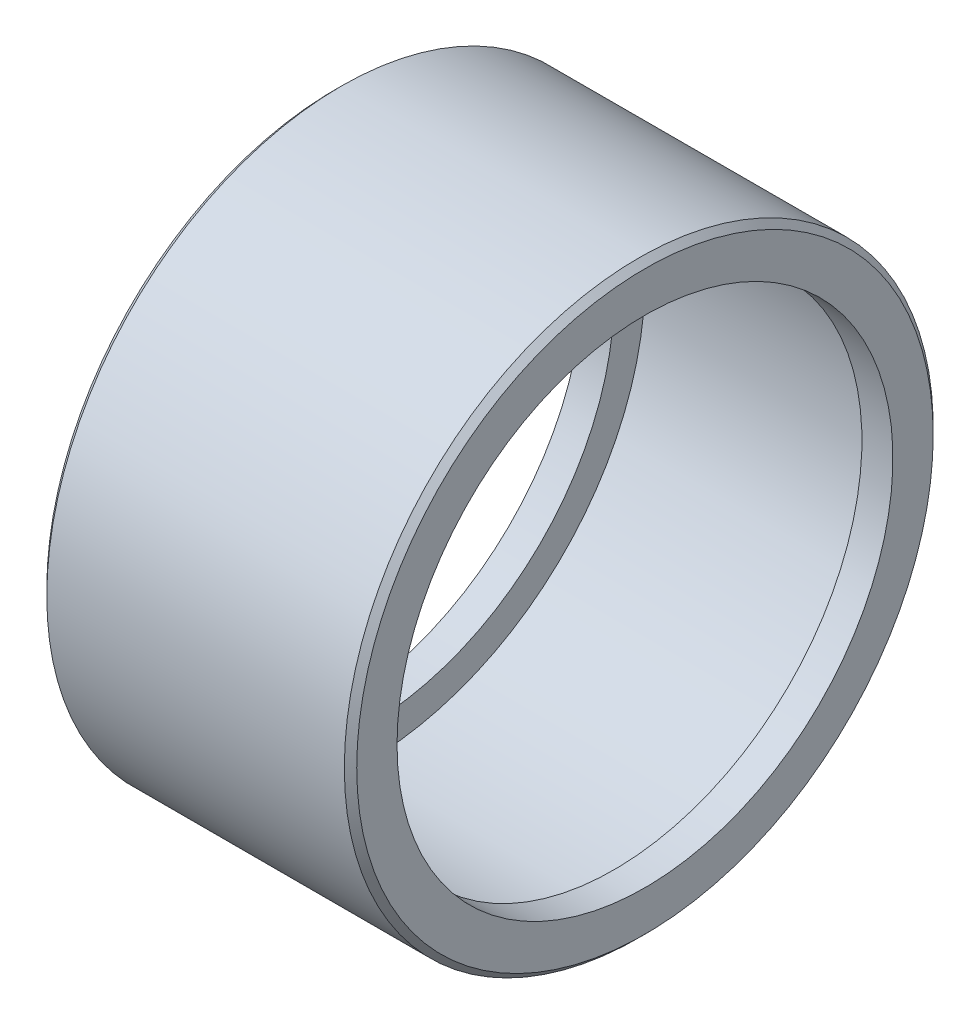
ISO-10303-21;
HEADER;
FILE_DESCRIPTION(('STEP AP214'),'2;1');
FILE_NAME('part.step','',(''),(''),'','','');
FILE_SCHEMA(('AUTOMOTIVE_DESIGN { 1 0 10303 214 1 1 1 1 }'));
ENDSEC;
DATA;
#1=APPLICATION_CONTEXT('core data for automotive mechanical design processes');
#2=APPLICATION_PROTOCOL_DEFINITION('international standard','automotive_design',2000,#1);
#3=PRODUCT_CONTEXT('',#1,'mechanical');
#4=PRODUCT('Part','Part','',(#3));
#5=PRODUCT_RELATED_PRODUCT_CATEGORY('part','',(#4));
#6=PRODUCT_DEFINITION_FORMATION('','',#4);
#7=PRODUCT_DEFINITION_CONTEXT('part definition',#1,'design');
#8=PRODUCT_DEFINITION('design','',#6,#7);
#9=PRODUCT_DEFINITION_SHAPE('','',#8);
#10=(LENGTH_UNIT() NAMED_UNIT(*) SI_UNIT(.MILLI.,.METRE.));
#11=(NAMED_UNIT(*) PLANE_ANGLE_UNIT() SI_UNIT($,.RADIAN.));
#12=(NAMED_UNIT(*) SI_UNIT($,.STERADIAN.) SOLID_ANGLE_UNIT());
#13=UNCERTAINTY_MEASURE_WITH_UNIT(LENGTH_MEASURE(1.E-05),#10,'distance_accuracy_value','');
#14=(GEOMETRIC_REPRESENTATION_CONTEXT(3) GLOBAL_UNCERTAINTY_ASSIGNED_CONTEXT((#13)) GLOBAL_UNIT_ASSIGNED_CONTEXT((#10,
#11,#12)) REPRESENTATION_CONTEXT('',''));
#15=CARTESIAN_POINT('',(0.,0.,0.));
#16=DIRECTION('',(0.,0.,1.));
#17=DIRECTION('',(1.,0.,0.));
#18=AXIS2_PLACEMENT_3D('',#15,#16,#17);
#19=CARTESIAN_POINT('',(-4.55642736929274,0.,0.));
#20=DIRECTION('',(-1.,0.,0.));
#21=DIRECTION('',(0.,0.,1.));
#22=AXIS2_PLACEMENT_3D('',#19,#20,#21);
#23=CYLINDRICAL_SURFACE('',#22,4.75);
#24=CARTESIAN_POINT('',(4.9,0.,0.));
#25=DIRECTION('',(-1.,0.,0.));
#26=DIRECTION('',(0.,0.,1.));
#27=AXIS2_PLACEMENT_3D('',#24,#25,#26);
#28=CIRCLE('',#27,4.75);
#29=CARTESIAN_POINT('',(4.9,0.,4.75));
#30=VERTEX_POINT('',#29);
#31=EDGE_CURVE('E360',#30,#30,#28,.T.);
#32=ORIENTED_EDGE('',*,*,#31,.T.);
#33=EDGE_LOOP('',(#32));
#34=FACE_BOUND('',#33,.T.);
#35=CARTESIAN_POINT('',(0.100000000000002,0.,0.));
#36=DIRECTION('',(1.,0.,0.));
#37=DIRECTION('',(0.,0.,-1.));
#38=AXIS2_PLACEMENT_3D('',#35,#36,#37);
#39=CIRCLE('',#38,4.75);
#40=CARTESIAN_POINT('',(0.100000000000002,0.,-4.75));
#41=VERTEX_POINT('',#40);
#42=EDGE_CURVE('E364',#41,#41,#39,.T.);
#43=ORIENTED_EDGE('',*,*,#42,.T.);
#44=EDGE_LOOP('',(#43));
#45=FACE_BOUND('',#44,.T.);
#46=ADVANCED_FACE('F350',(#34,#45),#23,.T.);
#47=CARTESIAN_POINT('',(0.,4.,0.));
#48=DIRECTION('',(1.,0.,0.));
#49=DIRECTION('',(0.,0.,-1.));
#50=AXIS2_PLACEMENT_3D('',#47,#48,#49);
#51=PLANE('',#50);
#52=CARTESIAN_POINT('',(0.,0.,0.));
#53=DIRECTION('',(1.,0.,0.));
#54=DIRECTION('',(0.,0.,-1.));
#55=AXIS2_PLACEMENT_3D('',#52,#53,#54);
#56=CIRCLE('',#55,4.65);
#57=CARTESIAN_POINT('',(0.,0.,-4.65));
#58=VERTEX_POINT('',#57);
#59=EDGE_CURVE('E10',#58,#58,#56,.F.);
#60=ORIENTED_EDGE('',*,*,#59,.T.);
#61=EDGE_LOOP('',(#60));
#62=FACE_BOUND('',#61,.T.);
#63=CARTESIAN_POINT('',(0.,0.,0.));
#64=DIRECTION('',(-1.,0.,0.));
#65=DIRECTION('',(0.,0.,1.));
#66=AXIS2_PLACEMENT_3D('',#63,#64,#65);
#67=CIRCLE('',#66,4.);
#68=CARTESIAN_POINT('',(0.,0.,4.));
#69=VERTEX_POINT('',#68);
#70=EDGE_CURVE('E369',#69,#69,#67,.T.);
#71=ORIENTED_EDGE('',*,*,#70,.F.);
#72=EDGE_LOOP('',(#71));
#73=FACE_BOUND('',#72,.T.);
#74=ADVANCED_FACE('F417',(#62,#73),#51,.F.);
#75=CARTESIAN_POINT('',(-4.55642736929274,0.,0.));
#76=DIRECTION('',(-1.,0.,0.));
#77=DIRECTION('',(0.,0.,1.));
#78=AXIS2_PLACEMENT_3D('',#75,#76,#77);
#79=CYLINDRICAL_SURFACE('',#78,4.);
#80=CARTESIAN_POINT('',(0.5,0.,0.));
#81=DIRECTION('',(-1.,0.,0.));
#82=DIRECTION('',(0.,0.,1.));
#83=AXIS2_PLACEMENT_3D('',#80,#81,#82);
#84=CIRCLE('',#83,4.);
#85=CARTESIAN_POINT('',(0.5,0.,4.));
#86=VERTEX_POINT('',#85);
#87=EDGE_CURVE('E372',#86,#86,#84,.T.);
#88=ORIENTED_EDGE('',*,*,#87,.F.);
#89=EDGE_LOOP('',(#88));
#90=FACE_BOUND('',#89,.T.);
#91=ORIENTED_EDGE('',*,*,#70,.T.);
#92=EDGE_LOOP('',(#91));
#93=FACE_BOUND('',#92,.T.);
#94=ADVANCED_FACE('F411',(#90,#93),#79,.F.);
#95=CARTESIAN_POINT('',(0.5,4.,0.));
#96=DIRECTION('',(-1.,0.,0.));
#97=DIRECTION('',(0.,0.,1.));
#98=AXIS2_PLACEMENT_3D('',#95,#96,#97);
#99=PLANE('',#98);
#100=CARTESIAN_POINT('',(0.5,0.,0.));
#101=DIRECTION('',(-1.,0.,0.));
#102=DIRECTION('',(0.,0.,1.));
#103=AXIS2_PLACEMENT_3D('',#100,#101,#102);
#104=CIRCLE('',#103,4.5);
#105=CARTESIAN_POINT('',(0.5,0.,4.5));
#106=VERTEX_POINT('',#105);
#107=EDGE_CURVE('E375',#106,#106,#104,.T.);
#108=ORIENTED_EDGE('',*,*,#107,.F.);
#109=EDGE_LOOP('',(#108));
#110=FACE_BOUND('',#109,.T.);
#111=ORIENTED_EDGE('',*,*,#87,.T.);
#112=EDGE_LOOP('',(#111));
#113=FACE_BOUND('',#112,.T.);
#114=ADVANCED_FACE('F405',(#110,#113),#99,.F.);
#115=CARTESIAN_POINT('',(-4.55642736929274,0.,0.));
#116=DIRECTION('',(-1.,0.,0.));
#117=DIRECTION('',(0.,0.,1.));
#118=AXIS2_PLACEMENT_3D('',#115,#116,#117);
#119=CYLINDRICAL_SURFACE('',#118,4.5);
#120=CARTESIAN_POINT('',(4.5,0.,0.));
#121=DIRECTION('',(-1.,0.,0.));
#122=DIRECTION('',(0.,0.,1.));
#123=AXIS2_PLACEMENT_3D('',#120,#121,#122);
#124=CIRCLE('',#123,4.5);
#125=CARTESIAN_POINT('',(4.5,0.,4.5));
#126=VERTEX_POINT('',#125);
#127=EDGE_CURVE('E378',#126,#126,#124,.T.);
#128=ORIENTED_EDGE('',*,*,#127,.F.);
#129=EDGE_LOOP('',(#128));
#130=FACE_BOUND('',#129,.T.);
#131=ORIENTED_EDGE('',*,*,#107,.T.);
#132=EDGE_LOOP('',(#131));
#133=FACE_BOUND('',#132,.T.);
#134=ADVANCED_FACE('F399',(#130,#133),#119,.F.);
#135=CARTESIAN_POINT('',(4.5,4.5,0.));
#136=DIRECTION('',(1.,0.,0.));
#137=DIRECTION('',(0.,0.,-1.));
#138=AXIS2_PLACEMENT_3D('',#135,#136,#137);
#139=PLANE('',#138);
#140=CARTESIAN_POINT('',(4.5,0.,0.));
#141=DIRECTION('',(-1.,0.,0.));
#142=DIRECTION('',(0.,0.,1.));
#143=AXIS2_PLACEMENT_3D('',#140,#141,#142);
#144=CIRCLE('',#143,4.);
#145=CARTESIAN_POINT('',(4.5,0.,4.));
#146=VERTEX_POINT('',#145);
#147=EDGE_CURVE('E381',#146,#146,#144,.T.);
#148=ORIENTED_EDGE('',*,*,#147,.F.);
#149=EDGE_LOOP('',(#148));
#150=FACE_BOUND('',#149,.T.);
#151=ORIENTED_EDGE('',*,*,#127,.T.);
#152=EDGE_LOOP('',(#151));
#153=FACE_BOUND('',#152,.T.);
#154=ADVANCED_FACE('F393',(#150,#153),#139,.F.);
#155=CARTESIAN_POINT('',(-4.55642736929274,0.,0.));
#156=DIRECTION('',(-1.,0.,0.));
#157=DIRECTION('',(0.,0.,1.));
#158=AXIS2_PLACEMENT_3D('',#155,#156,#157);
#159=CYLINDRICAL_SURFACE('',#158,4.);
#160=CARTESIAN_POINT('',(5.,0.,0.));
#161=DIRECTION('',(-1.,0.,0.));
#162=DIRECTION('',(0.,0.,1.));
#163=AXIS2_PLACEMENT_3D('',#160,#161,#162);
#164=CIRCLE('',#163,4.);
#165=CARTESIAN_POINT('',(5.,0.,4.));
#166=VERTEX_POINT('',#165);
#167=EDGE_CURVE('E384',#166,#166,#164,.T.);
#168=ORIENTED_EDGE('',*,*,#167,.F.);
#169=EDGE_LOOP('',(#168));
#170=FACE_BOUND('',#169,.T.);
#171=ORIENTED_EDGE('',*,*,#147,.T.);
#172=EDGE_LOOP('',(#171));
#173=FACE_BOUND('',#172,.T.);
#174=ADVANCED_FACE('F390',(#170,#173),#159,.F.);
#175=CARTESIAN_POINT('',(5.,4.75,0.));
#176=DIRECTION('',(-1.,0.,0.));
#177=DIRECTION('',(0.,0.,1.));
#178=AXIS2_PLACEMENT_3D('',#175,#176,#177);
#179=PLANE('',#178);
#180=CARTESIAN_POINT('',(5.,0.,0.));
#181=DIRECTION('',(-1.,0.,0.));
#182=DIRECTION('',(0.,0.,1.));
#183=AXIS2_PLACEMENT_3D('',#180,#181,#182);
#184=CIRCLE('',#183,4.65);
#185=CARTESIAN_POINT('',(5.,0.,4.65));
#186=VERTEX_POINT('',#185);
#187=EDGE_CURVE('E356',#186,#186,#184,.F.);
#188=ORIENTED_EDGE('',*,*,#187,.T.);
#189=EDGE_LOOP('',(#188));
#190=FACE_BOUND('',#189,.T.);
#191=ORIENTED_EDGE('',*,*,#167,.T.);
#192=EDGE_LOOP('',(#191));
#193=FACE_BOUND('',#192,.T.);
#194=ADVANCED_FACE('F388',(#190,#193),#179,.F.);
#195=CARTESIAN_POINT('',(4.9,0.,0.));
#196=DIRECTION('',(-1.,0.,0.));
#197=DIRECTION('',(0.,0.,1.));
#198=AXIS2_PLACEMENT_3D('',#195,#196,#197);
#199=CONICAL_SURFACE('',#198,4.75,0.785398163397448);
#200=ORIENTED_EDGE('',*,*,#187,.F.);
#201=EDGE_LOOP('',(#200));
#202=FACE_BOUND('',#201,.T.);
#203=ORIENTED_EDGE('',*,*,#31,.F.);
#204=EDGE_LOOP('',(#203));
#205=FACE_BOUND('',#204,.T.);
#206=ADVANCED_FACE('F429',(#202,#205),#199,.T.);
#207=CARTESIAN_POINT('',(0.,0.,0.));
#208=DIRECTION('',(1.,0.,0.));
#209=DIRECTION('',(0.,0.,-1.));
#210=AXIS2_PLACEMENT_3D('',#207,#208,#209);
#211=CONICAL_SURFACE('',#210,4.65,0.785398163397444);
#212=ORIENTED_EDGE('',*,*,#42,.F.);
#213=EDGE_LOOP('',(#212));
#214=FACE_BOUND('',#213,.T.);
#215=ORIENTED_EDGE('',*,*,#59,.F.);
#216=EDGE_LOOP('',(#215));
#217=FACE_BOUND('',#216,.T.);
#218=ADVANCED_FACE('F432',(#214,#217),#211,.T.);
#219=CLOSED_SHELL('',(#46,#74,#94,#114,#134,#154,#174,#194,#206,#218));
#220=MANIFOLD_SOLID_BREP('B2',#219);
#221=ADVANCED_BREP_SHAPE_REPRESENTATION('',(#18,#220),#14);
#222=SHAPE_DEFINITION_REPRESENTATION(#9,#221);
ENDSEC;
END-ISO-10303-21;
